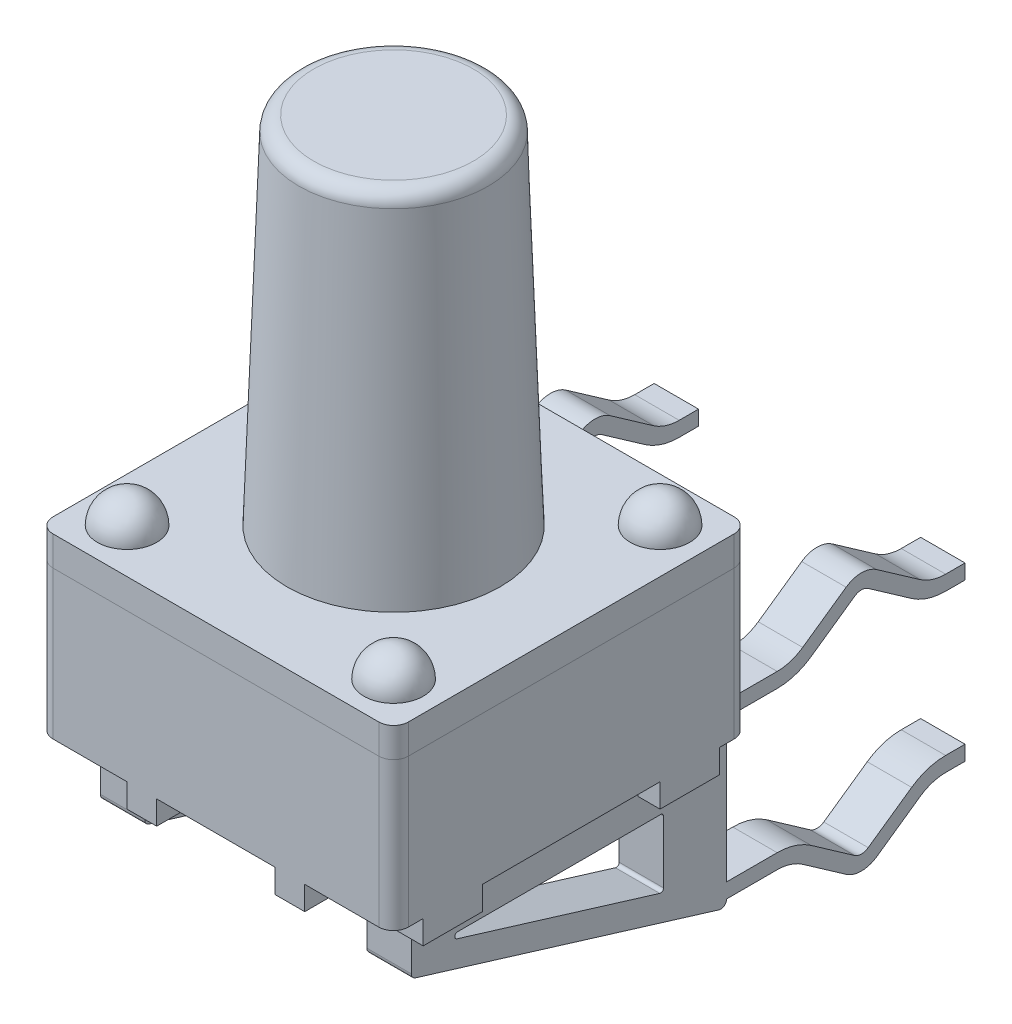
from build123d import *

# Parameters (mm, degrees)
SKETCH1_W            = 6
SKETCH1_H            = 6
EXTRUDE1_DEPTH       = 3.4
SKETCH2_W            = 1.5
SKETCH2_H            = 3
SKETCH2_H_2          = 0.5
SKETCH2_W_2          = 2
SKETCH2_H_3          = 6
SKETCH2_W_3          = 1
EXTRUDE2_DEPTH       = 0.4
REVOLVE1_ANGLE       = 180
LPATTERN1_COUNT      = 2
LPATTERN1_PITCH      = 4.5
LPATTERN1_COUNT_DIR2 = 2
LPATTERN1_PITCH_DIR2 = 4.5
SKETCH4_R            = 1.8
EXTRUDE3_DEPTH       = 6
EXTRUDE3_TAPER       = 2
EXTRUDE4_DEPTH       = 0.375
BOSS_EXTRUDE1_START  = 1.875
BOSS_EXTRUDE1_DEPTH  = 0.75
BOSS_EXTRUDE2_START  = -2.625
BOSS_EXTRUDE2_DEPTH  = 0.75
FILLET1_R            = 0.25


with BuildPart() as part:
    # Sketch1 → Extrude1 (new body)
    with BuildSketch(Plane(origin=(0, 0, 0), x_dir=(1, 0, 0), z_dir=(0, 1, 0))):
        Rectangle(SKETCH1_W, SKETCH1_H)
    extrude(amount=EXTRUDE1_DEPTH)

    # Sketch2 → Extrude2 (cut)
    # profile 1 of 7: a face of its own
    with BuildSketch(Plane.XZ):
        with Locations((-2.25, 0)):
            Rectangle(SKETCH2_W, SKETCH2_H)
    # profile 2 of 7: a face of its own
    with BuildSketch(Plane.XZ):
        with Locations((-2.25, -2.75)):
            Rectangle(SKETCH2_W, SKETCH2_H_2)
    # profile 3 of 7: a face of its own
    with BuildSketch(Plane.XZ):
        with Locations((-2.25, 2.75)):
            Rectangle(SKETCH2_W, SKETCH2_H_2)
    # profile 4 of 7: a face of its own
    with BuildSketch(Plane.XZ):
        Rectangle(SKETCH2_W_2, SKETCH2_H_3)
        with Locations((0, -2.25)):
            Rectangle(SKETCH2_W_3, SKETCH2_H_2, mode=Mode.SUBTRACT)
        with Locations((0, 2.25)):
            Rectangle(SKETCH2_W_3, SKETCH2_H_2, mode=Mode.SUBTRACT)
        Rectangle(SKETCH2_W_3, SKETCH2_H_2, mode=Mode.SUBTRACT)
    # profile 5 of 7: a face of its own
    with BuildSketch(Plane.XZ):
        with Locations((2.25, 2.75)):
            Rectangle(SKETCH2_W, SKETCH2_H_2)
    # profile 6 of 7: a face of its own
    with BuildSketch(Plane.XZ):
        with Locations((2.25, -2.75)):
            Rectangle(SKETCH2_W, SKETCH2_H_2)
    # profile 7 of 7: a face of its own
    with BuildSketch(Plane.XZ):
        with Locations((2.25, 0)):
            Rectangle(SKETCH2_W, SKETCH2_H)
    extrude(amount=-EXTRUDE2_DEPTH, mode=Mode.SUBTRACT)

    # Sketch3 → Revolve1 (revolve)
    with BuildSketch(Plane(origin=(0, 3.4, 0), x_dir=(1, 0, 0), z_dir=(0, 1, 0))):
        with BuildLine():
            Line((-2.25, 1.75), (-2.25, 2.75))
            ThreePointArc((-2.25, 2.75), (-2.75, 2.25), (-2.25, 1.75))
        make_face()
    revolve1 = revolve(axis=Axis((-2.25, 3.4, -1.75), (0, 0, -1)), revolution_arc=REVOLVE1_ANGLE)

    # LPattern1: Revolve1 2 × 2
    with Locations(*[(i * LPATTERN1_PITCH, 0, j * LPATTERN1_PITCH_DIR2) for i in range(LPATTERN1_COUNT) for j in range(LPATTERN1_COUNT_DIR2) if (i, j) != (0, 0)]):
        add(revolve1)

    # Sketch4 → Extrude3 (add)
    with BuildSketch(Plane(origin=(0, 3.4, 0), x_dir=(1, 0, 0), z_dir=(0, 1, 0))):
        Circle(SKETCH4_R)
    extrude(amount=EXTRUDE3_DEPTH, taper=EXTRUDE3_TAPER)

    # Sketch5 → Extrude4 (add, symmetric)
    with BuildSketch(Plane(origin=(2.25, 0, 0), x_dir=(0, 0, -1), z_dir=(1, 0, 0))):
        with BuildLine():
            Line((7.025, 0.4), (6.697113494, 0.4))
            ThreePointArc((6.697113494, 0.4), (6.396407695, 0.446283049), (6.123537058, 0.580847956))
            Line((6.123537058, 0.580847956), (5.389715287, 1.094675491))
            ThreePointArc((5.389715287, 1.094675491), (5.275, 1.130845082), (5.160284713, 1.094675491))
            Line((5.160284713, 1.094675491), (4.426462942, 0.580847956))
            ThreePointArc((4.426462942, 0.580847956), (4.153592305, 0.446283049), (3.852886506, 0.4))
            Line((3.852886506, 0.4), (3, 0.4))
            Line((3, 0.4), (3, 0.65))
            Line((3, 0.65), (3.852886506, 0.65))
            ThreePointArc((3.852886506, 0.65), (4.078415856, 0.684712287), (4.283068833, 0.785635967))
            Line((4.283068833, 0.785635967), (5.016890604, 1.299463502))
            ThreePointArc((5.016890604, 1.299463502), (5.275, 1.380845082), (5.533109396, 1.299463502))
            Line((5.533109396, 1.299463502), (6.266931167, 0.785635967))
            ThreePointArc((6.266931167, 0.785635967), (6.471584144, 0.684712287), (6.697113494, 0.65))
            Line((6.697113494, 0.65), (7.025, 0.65))
            Line((7.025, 0.65), (7.025, 0.4))
        make_face()
    extrude4 = extrude(amount=EXTRUDE4_DEPTH, both=True)

    # Mirror1: Extrude4 across plane
    add(extrude4.mirror(Plane(origin=(0, 0, 0), x_dir=(0, 0, 1), z_dir=(1, 0, 0))))

    # Sketch6 → Boss-Extrude1 (add)
    with BuildSketch(Plane(origin=(0, 0, 0), x_dir=(0, 0, -1), z_dir=(1, 0, 0)).offset(BOSS_EXTRUDE1_START)):
        with BuildLine():
            Line((-2.326016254, 0.696411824), (-2.326016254, -0.682322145))
            ThreePointArc((-2.326016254, -0.682322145), (-2.306407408, -0.741797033), (-2.255271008, -0.777947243))
            Line((-2.255271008, -0.777947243), (2.870745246, -2.346158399))
            ThreePointArc((2.870745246, -2.346158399), (2.959474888, -2.330924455), (3, -2.250533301))
            Line((3, -2.250533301), (3.852886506, -2.250533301))
            ThreePointArc((3.852886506, -2.250533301), (4.078415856, -2.285245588), (4.283068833, -2.386169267))
            Line((4.283068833, -2.386169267), (5.016890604, -2.899996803))
            ThreePointArc((5.016890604, -2.899996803), (5.275, -2.981378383), (5.533109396, -2.899996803))
            Line((5.533109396, -2.899996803), (6.266931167, -2.386169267))
            ThreePointArc((6.266931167, -2.386169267), (6.471584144, -2.285245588), (6.697113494, -2.250533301))
            Line((6.697113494, -2.250533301), (7.025, -2.250533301))
            Line((7.025, -2.250533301), (7.025, -2.000533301))
            Line((7.025, -2.000533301), (6.697113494, -2.000533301))
            ThreePointArc((6.697113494, -2.000533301), (6.396407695, -2.04681635), (6.123537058, -2.181381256))
            Line((6.123537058, -2.181381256), (5.389715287, -2.695208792))
            ThreePointArc((5.389715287, -2.695208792), (5.275, -2.731378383), (5.160284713, -2.695208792))
            Line((5.160284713, -2.695208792), (4.426462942, -2.181381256))
            ThreePointArc((4.426462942, -2.181381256), (4.153592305, -2.04681635), (3.852886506, -2.000533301))
            Line((3.852886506, -2.000533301), (3, -2.000533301))
            Line((3, -2.000533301), (3, 0.696411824))
            Line((3, 0.696411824), (-2.326016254, 0.696411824))
        make_face()
        with BuildLine():
            Line((-1.555746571, -0.556487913), (1.870045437, -1.60454648))
            ThreePointArc((1.870045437, -1.60454648), (1.914410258, -1.596929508), (1.934672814, -1.556733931))
            Line((1.934672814, -1.556733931), (1.934672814, -0.508675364))
            ThreePointArc((1.934672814, -0.508675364), (1.920028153, -0.473320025), (1.884672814, -0.458675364))
            Line((1.884672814, -0.458675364), (-1.541119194, -0.458675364))
            ThreePointArc((-1.541119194, -0.458675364), (-1.590569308, -0.501280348), (-1.555746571, -0.556487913))
        make_face(mode=Mode.SUBTRACT)
    extrude(amount=BOSS_EXTRUDE1_DEPTH)

    # Sketch6_2 → Boss-Extrude2 (add)
    with BuildSketch(Plane(origin=(0, 0, 0), x_dir=(0, 0, -1), z_dir=(1, 0, 0)).offset(BOSS_EXTRUDE2_START)):
        with BuildLine():
            Line((-2.326016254, 0.696411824), (-2.326016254, -0.682322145))
            ThreePointArc((-2.326016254, -0.682322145), (-2.306407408, -0.741797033), (-2.255271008, -0.777947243))
            Line((-2.255271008, -0.777947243), (2.870745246, -2.346158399))
            ThreePointArc((2.870745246, -2.346158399), (2.959474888, -2.330924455), (3, -2.250533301))
            Line((3, -2.250533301), (3.852886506, -2.250533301))
            ThreePointArc((3.852886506, -2.250533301), (4.078415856, -2.285245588), (4.283068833, -2.386169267))
            Line((4.283068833, -2.386169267), (5.016890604, -2.899996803))
            ThreePointArc((5.016890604, -2.899996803), (5.275, -2.981378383), (5.533109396, -2.899996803))
            Line((5.533109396, -2.899996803), (6.266931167, -2.386169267))
            ThreePointArc((6.266931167, -2.386169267), (6.471584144, -2.285245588), (6.697113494, -2.250533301))
            Line((6.697113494, -2.250533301), (7.025, -2.250533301))
            Line((7.025, -2.250533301), (7.025, -2.000533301))
            Line((7.025, -2.000533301), (6.697113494, -2.000533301))
            ThreePointArc((6.697113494, -2.000533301), (6.396407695, -2.04681635), (6.123537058, -2.181381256))
            Line((6.123537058, -2.181381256), (5.389715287, -2.695208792))
            ThreePointArc((5.389715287, -2.695208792), (5.275, -2.731378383), (5.160284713, -2.695208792))
            Line((5.160284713, -2.695208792), (4.426462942, -2.181381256))
            ThreePointArc((4.426462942, -2.181381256), (4.153592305, -2.04681635), (3.852886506, -2.000533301))
            Line((3.852886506, -2.000533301), (3, -2.000533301))
            Line((3, -2.000533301), (3, 0.696411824))
            Line((3, 0.696411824), (-2.326016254, 0.696411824))
        make_face()
        with BuildLine():
            Line((-1.555746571, -0.556487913), (1.870045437, -1.60454648))
            ThreePointArc((1.870045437, -1.60454648), (1.914410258, -1.596929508), (1.934672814, -1.556733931))
            Line((1.934672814, -1.556733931), (1.934672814, -0.508675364))
            ThreePointArc((1.934672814, -0.508675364), (1.920028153, -0.473320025), (1.884672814, -0.458675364))
            Line((1.884672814, -0.458675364), (-1.541119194, -0.458675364))
            ThreePointArc((-1.541119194, -0.458675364), (-1.590569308, -0.501280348), (-1.555746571, -0.556487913))
        make_face(mode=Mode.SUBTRACT)
    extrude(amount=BOSS_EXTRUDE2_DEPTH)

    # Fillet1
    fillet1_edges = [part.edges().sort_by_distance(p)[0] for p in [
        (-1.590475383, 9.4, 0),
        (3, 1.9, 3),
        (-3, 1.9, 3),
        (-3, 1.9, -3),
        (3, 1.9, -3),
        (3, 1.9, 3),
        (-3, 1.9, 3),
        (-3, 1.9, -3),
        (3, 1.9, -3),
    ]]
    fillet(fillet1_edges, radius=FILLET1_R)


solid = part.part
